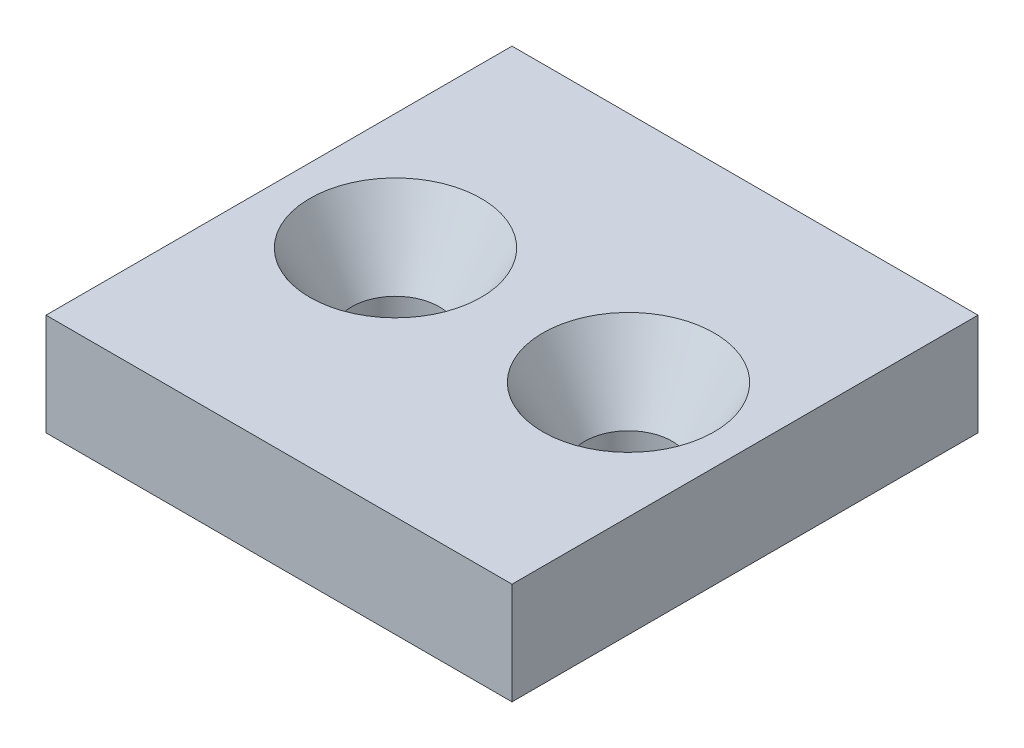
ISO-10303-21;
HEADER;
FILE_DESCRIPTION(('STEP AP214'),'2;1');
FILE_NAME('part.step','',(''),(''),'','','');
FILE_SCHEMA(('AUTOMOTIVE_DESIGN { 1 0 10303 214 1 1 1 1 }'));
ENDSEC;
DATA;
#1=APPLICATION_CONTEXT('core data for automotive mechanical design processes');
#2=APPLICATION_PROTOCOL_DEFINITION('international standard','automotive_design',2000,#1);
#3=PRODUCT_CONTEXT('',#1,'mechanical');
#4=PRODUCT('Part','Part','',(#3));
#5=PRODUCT_RELATED_PRODUCT_CATEGORY('part','',(#4));
#6=PRODUCT_DEFINITION_FORMATION('','',#4);
#7=PRODUCT_DEFINITION_CONTEXT('part definition',#1,'design');
#8=PRODUCT_DEFINITION('design','',#6,#7);
#9=PRODUCT_DEFINITION_SHAPE('','',#8);
#10=(LENGTH_UNIT() NAMED_UNIT(*) SI_UNIT(.MILLI.,.METRE.));
#11=(NAMED_UNIT(*) PLANE_ANGLE_UNIT() SI_UNIT($,.RADIAN.));
#12=(NAMED_UNIT(*) SI_UNIT($,.STERADIAN.) SOLID_ANGLE_UNIT());
#13=UNCERTAINTY_MEASURE_WITH_UNIT(LENGTH_MEASURE(1.E-05),#10,'distance_accuracy_value','');
#14=(GEOMETRIC_REPRESENTATION_CONTEXT(3) GLOBAL_UNCERTAINTY_ASSIGNED_CONTEXT((#13)) GLOBAL_UNIT_ASSIGNED_CONTEXT((#10,
#11,#12)) REPRESENTATION_CONTEXT('',''));
#15=CARTESIAN_POINT('',(0.,0.,0.));
#16=DIRECTION('',(0.,0.,1.));
#17=DIRECTION('',(1.,0.,0.));
#18=AXIS2_PLACEMENT_3D('',#15,#16,#17);
#19=CARTESIAN_POINT('',(16.,7.,16.));
#20=DIRECTION('',(-1.,0.,0.));
#21=DIRECTION('',(0.,0.,1.));
#22=AXIS2_PLACEMENT_3D('',#19,#20,#21);
#23=PLANE('',#22);
#24=DIRECTION('',(0.,0.,-1.));
#25=VECTOR('',#24,1.);
#26=CARTESIAN_POINT('',(16.,0.,16.));
#27=LINE('',#26,#25);
#28=CARTESIAN_POINT('',(16.,0.,16.));
#29=VERTEX_POINT('',#28);
#30=CARTESIAN_POINT('',(16.,0.,-16.));
#31=VERTEX_POINT('',#30);
#32=EDGE_CURVE('E95',#29,#31,#27,.T.);
#33=ORIENTED_EDGE('',*,*,#32,.T.);
#34=DIRECTION('',(0.,-1.,0.));
#35=VECTOR('',#34,1.);
#36=CARTESIAN_POINT('',(16.,7.,-16.));
#37=LINE('',#36,#35);
#38=CARTESIAN_POINT('',(16.,7.,-16.));
#39=VERTEX_POINT('',#38);
#40=EDGE_CURVE('E11',#39,#31,#37,.T.);
#41=ORIENTED_EDGE('',*,*,#40,.F.);
#42=DIRECTION('',(0.,0.,-1.));
#43=VECTOR('',#42,1.);
#44=CARTESIAN_POINT('',(16.,7.,16.));
#45=LINE('',#44,#43);
#46=CARTESIAN_POINT('',(16.,7.,16.));
#47=VERTEX_POINT('',#46);
#48=EDGE_CURVE('E83',#47,#39,#45,.T.);
#49=ORIENTED_EDGE('',*,*,#48,.F.);
#50=DIRECTION('',(0.,-1.,0.));
#51=VECTOR('',#50,1.);
#52=CARTESIAN_POINT('',(16.,7.,16.));
#53=LINE('',#52,#51);
#54=EDGE_CURVE('E91',#47,#29,#53,.T.);
#55=ORIENTED_EDGE('',*,*,#54,.T.);
#56=EDGE_LOOP('',(#33,#41,#49,#55));
#57=FACE_BOUND('',#56,.T.);
#58=ADVANCED_FACE('F32',(#57),#23,.F.);
#59=CARTESIAN_POINT('',(-16.,7.,-16.));
#60=DIRECTION('',(0.,0.,1.));
#61=DIRECTION('',(1.,0.,0.));
#62=AXIS2_PLACEMENT_3D('',#59,#60,#61);
#63=PLANE('',#62);
#64=DIRECTION('',(-1.,0.,0.));
#65=VECTOR('',#64,1.);
#66=CARTESIAN_POINT('',(-16.,0.,-16.));
#67=LINE('',#66,#65);
#68=CARTESIAN_POINT('',(-16.,0.,-16.));
#69=VERTEX_POINT('',#68);
#70=EDGE_CURVE('E87',#31,#69,#67,.T.);
#71=ORIENTED_EDGE('',*,*,#70,.T.);
#72=DIRECTION('',(0.,-1.,0.));
#73=VECTOR('',#72,1.);
#74=CARTESIAN_POINT('',(-16.,7.,-16.));
#75=LINE('',#74,#73);
#76=CARTESIAN_POINT('',(-16.,7.,-16.));
#77=VERTEX_POINT('',#76);
#78=EDGE_CURVE('E40',#77,#69,#75,.T.);
#79=ORIENTED_EDGE('',*,*,#78,.F.);
#80=DIRECTION('',(-1.,0.,0.));
#81=VECTOR('',#80,1.);
#82=CARTESIAN_POINT('',(-16.,7.,-16.));
#83=LINE('',#82,#81);
#84=EDGE_CURVE('E78',#39,#77,#83,.T.);
#85=ORIENTED_EDGE('',*,*,#84,.F.);
#86=ORIENTED_EDGE('',*,*,#40,.T.);
#87=EDGE_LOOP('',(#71,#79,#85,#86));
#88=FACE_BOUND('',#87,.T.);
#89=ADVANCED_FACE('F86',(#88),#63,.F.);
#90=CARTESIAN_POINT('',(-16.,7.,16.));
#91=DIRECTION('',(1.,0.,0.));
#92=DIRECTION('',(0.,0.,-1.));
#93=AXIS2_PLACEMENT_3D('',#90,#91,#92);
#94=PLANE('',#93);
#95=DIRECTION('',(0.,0.,1.));
#96=VECTOR('',#95,1.);
#97=CARTESIAN_POINT('',(-16.,0.,16.));
#98=LINE('',#97,#96);
#99=CARTESIAN_POINT('',(-16.,0.,16.));
#100=VERTEX_POINT('',#99);
#101=EDGE_CURVE('E65',#69,#100,#98,.T.);
#102=ORIENTED_EDGE('',*,*,#101,.T.);
#103=DIRECTION('',(0.,-1.,0.));
#104=VECTOR('',#103,1.);
#105=CARTESIAN_POINT('',(-16.,7.,16.));
#106=LINE('',#105,#104);
#107=CARTESIAN_POINT('',(-16.,7.,16.));
#108=VERTEX_POINT('',#107);
#109=EDGE_CURVE('E88',#108,#100,#106,.T.);
#110=ORIENTED_EDGE('',*,*,#109,.F.);
#111=DIRECTION('',(0.,0.,1.));
#112=VECTOR('',#111,1.);
#113=CARTESIAN_POINT('',(-16.,7.,16.));
#114=LINE('',#113,#112);
#115=EDGE_CURVE('E81',#77,#108,#114,.T.);
#116=ORIENTED_EDGE('',*,*,#115,.F.);
#117=ORIENTED_EDGE('',*,*,#78,.T.);
#118=EDGE_LOOP('',(#102,#110,#116,#117));
#119=FACE_BOUND('',#118,.T.);
#120=ADVANCED_FACE('F89',(#119),#94,.F.);
#121=CARTESIAN_POINT('',(-16.,7.,16.));
#122=DIRECTION('',(0.,0.,-1.));
#123=DIRECTION('',(-1.,0.,0.));
#124=AXIS2_PLACEMENT_3D('',#121,#122,#123);
#125=PLANE('',#124);
#126=DIRECTION('',(1.,0.,0.));
#127=VECTOR('',#126,1.);
#128=CARTESIAN_POINT('',(-16.,0.,16.));
#129=LINE('',#128,#127);
#130=EDGE_CURVE('E71',#100,#29,#129,.T.);
#131=ORIENTED_EDGE('',*,*,#130,.T.);
#132=ORIENTED_EDGE('',*,*,#54,.F.);
#133=DIRECTION('',(1.,0.,0.));
#134=VECTOR('',#133,1.);
#135=CARTESIAN_POINT('',(-16.,7.,16.));
#136=LINE('',#135,#134);
#137=EDGE_CURVE('E48',#108,#47,#136,.T.);
#138=ORIENTED_EDGE('',*,*,#137,.F.);
#139=ORIENTED_EDGE('',*,*,#109,.T.);
#140=EDGE_LOOP('',(#131,#132,#138,#139));
#141=FACE_BOUND('',#140,.T.);
#142=ADVANCED_FACE('F103',(#141),#125,.F.);
#143=CARTESIAN_POINT('',(16.,7.,-16.));
#144=DIRECTION('',(0.,-1.,0.));
#145=DIRECTION('',(0.,0.,-1.));
#146=AXIS2_PLACEMENT_3D('',#143,#144,#145);
#147=PLANE('',#146);
#148=CARTESIAN_POINT('',(-8.,7.,0.));
#149=DIRECTION('',(0.,1.,0.));
#150=DIRECTION('',(0.,0.,1.));
#151=AXIS2_PLACEMENT_3D('',#148,#149,#150);
#152=CIRCLE('',#151,5.885);
#153=CARTESIAN_POINT('',(-8.,7.,5.885));
#154=VERTEX_POINT('',#153);
#155=EDGE_CURVE('E123',#154,#154,#152,.T.);
#156=ORIENTED_EDGE('',*,*,#155,.F.);
#157=EDGE_LOOP('',(#156));
#158=FACE_BOUND('',#157,.T.);
#159=CARTESIAN_POINT('',(8.,7.,0.));
#160=DIRECTION('',(0.,1.,0.));
#161=DIRECTION('',(0.,0.,1.));
#162=AXIS2_PLACEMENT_3D('',#159,#160,#161);
#163=CIRCLE('',#162,5.885);
#164=CARTESIAN_POINT('',(8.,7.,5.885));
#165=VERTEX_POINT('',#164);
#166=EDGE_CURVE('E114',#165,#165,#163,.T.);
#167=ORIENTED_EDGE('',*,*,#166,.F.);
#168=EDGE_LOOP('',(#167));
#169=FACE_BOUND('',#168,.T.);
#170=ORIENTED_EDGE('',*,*,#48,.T.);
#171=ORIENTED_EDGE('',*,*,#84,.T.);
#172=ORIENTED_EDGE('',*,*,#115,.T.);
#173=ORIENTED_EDGE('',*,*,#137,.T.);
#174=EDGE_LOOP('',(#170,#171,#172,#173));
#175=FACE_BOUND('',#174,.T.);
#176=ADVANCED_FACE('F79',(#158,#169,#175),#147,.F.);
#177=CARTESIAN_POINT('',(16.,0.,-16.));
#178=DIRECTION('',(0.,-1.,0.));
#179=DIRECTION('',(0.,0.,-1.));
#180=AXIS2_PLACEMENT_3D('',#177,#178,#179);
#181=PLANE('',#180);
#182=CARTESIAN_POINT('',(-8.,0.,0.));
#183=DIRECTION('',(0.,1.,0.));
#184=DIRECTION('',(0.,0.,1.));
#185=AXIS2_PLACEMENT_3D('',#182,#183,#184);
#186=CIRCLE('',#185,3.);
#187=CARTESIAN_POINT('',(-8.,0.,3.));
#188=VERTEX_POINT('',#187);
#189=EDGE_CURVE('E117',#188,#188,#186,.T.);
#190=ORIENTED_EDGE('',*,*,#189,.T.);
#191=EDGE_LOOP('',(#190));
#192=FACE_BOUND('',#191,.T.);
#193=CARTESIAN_POINT('',(8.,0.,0.));
#194=DIRECTION('',(0.,1.,0.));
#195=DIRECTION('',(0.,0.,1.));
#196=AXIS2_PLACEMENT_3D('',#193,#194,#195);
#197=CIRCLE('',#196,3.);
#198=CARTESIAN_POINT('',(8.,0.,3.));
#199=VERTEX_POINT('',#198);
#200=EDGE_CURVE('E98',#199,#199,#197,.T.);
#201=ORIENTED_EDGE('',*,*,#200,.T.);
#202=EDGE_LOOP('',(#201));
#203=FACE_BOUND('',#202,.T.);
#204=ORIENTED_EDGE('',*,*,#32,.F.);
#205=ORIENTED_EDGE('',*,*,#130,.F.);
#206=ORIENTED_EDGE('',*,*,#101,.F.);
#207=ORIENTED_EDGE('',*,*,#70,.F.);
#208=EDGE_LOOP('',(#204,#205,#206,#207));
#209=FACE_BOUND('',#208,.T.);
#210=ADVANCED_FACE('F106',(#192,#203,#209),#181,.T.);
#211=CARTESIAN_POINT('',(8.,7.,0.));
#212=DIRECTION('',(0.,1.,0.));
#213=DIRECTION('',(0.,0.,1.));
#214=AXIS2_PLACEMENT_3D('',#211,#212,#213);
#215=CYLINDRICAL_SURFACE('',#214,3.);
#216=ORIENTED_EDGE('',*,*,#200,.F.);
#217=EDGE_LOOP('',(#216));
#218=FACE_BOUND('',#217,.T.);
#219=CARTESIAN_POINT('',(8.,2.00303342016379,0.));
#220=DIRECTION('',(0.,1.,0.));
#221=DIRECTION('',(0.,0.,1.));
#222=AXIS2_PLACEMENT_3D('',#219,#220,#221);
#223=CIRCLE('',#222,3.);
#224=CARTESIAN_POINT('',(8.,2.00303342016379,3.));
#225=VERTEX_POINT('',#224);
#226=EDGE_CURVE('E111',#225,#225,#223,.T.);
#227=ORIENTED_EDGE('',*,*,#226,.T.);
#228=EDGE_LOOP('',(#227));
#229=FACE_BOUND('',#228,.T.);
#230=ADVANCED_FACE('F137',(#218,#229),#215,.F.);
#231=CARTESIAN_POINT('',(8.,7.,0.));
#232=DIRECTION('',(0.,1.,0.));
#233=DIRECTION('',(0.,0.,1.));
#234=AXIS2_PLACEMENT_3D('',#231,#232,#233);
#235=CONICAL_SURFACE('',#234,5.885,0.523598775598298);
#236=ORIENTED_EDGE('',*,*,#226,.F.);
#237=EDGE_LOOP('',(#236));
#238=FACE_BOUND('',#237,.T.);
#239=ORIENTED_EDGE('',*,*,#166,.T.);
#240=EDGE_LOOP('',(#239));
#241=FACE_BOUND('',#240,.T.);
#242=ADVANCED_FACE('F134',(#238,#241),#235,.F.);
#243=CARTESIAN_POINT('',(-8.,7.,0.));
#244=DIRECTION('',(0.,1.,0.));
#245=DIRECTION('',(0.,0.,1.));
#246=AXIS2_PLACEMENT_3D('',#243,#244,#245);
#247=CYLINDRICAL_SURFACE('',#246,3.);
#248=ORIENTED_EDGE('',*,*,#189,.F.);
#249=EDGE_LOOP('',(#248));
#250=FACE_BOUND('',#249,.T.);
#251=CARTESIAN_POINT('',(-8.,2.00303342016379,0.));
#252=DIRECTION('',(0.,1.,0.));
#253=DIRECTION('',(0.,0.,1.));
#254=AXIS2_PLACEMENT_3D('',#251,#252,#253);
#255=CIRCLE('',#254,3.);
#256=CARTESIAN_POINT('',(-8.,2.00303342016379,3.));
#257=VERTEX_POINT('',#256);
#258=EDGE_CURVE('E120',#257,#257,#255,.T.);
#259=ORIENTED_EDGE('',*,*,#258,.T.);
#260=EDGE_LOOP('',(#259));
#261=FACE_BOUND('',#260,.T.);
#262=ADVANCED_FACE('F136',(#250,#261),#247,.F.);
#263=CARTESIAN_POINT('',(-8.,7.,0.));
#264=DIRECTION('',(0.,1.,0.));
#265=DIRECTION('',(0.,0.,1.));
#266=AXIS2_PLACEMENT_3D('',#263,#264,#265);
#267=CONICAL_SURFACE('',#266,5.885,0.523598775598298);
#268=ORIENTED_EDGE('',*,*,#258,.F.);
#269=EDGE_LOOP('',(#268));
#270=FACE_BOUND('',#269,.T.);
#271=ORIENTED_EDGE('',*,*,#155,.T.);
#272=EDGE_LOOP('',(#271));
#273=FACE_BOUND('',#272,.T.);
#274=ADVANCED_FACE('F127',(#270,#273),#267,.F.);
#275=CLOSED_SHELL('',(#58,#89,#120,#142,#176,#210,#230,#242,#262,#274));
#276=MANIFOLD_SOLID_BREP('B2',#275);
#277=ADVANCED_BREP_SHAPE_REPRESENTATION('',(#18,#276),#14);
#278=SHAPE_DEFINITION_REPRESENTATION(#9,#277);
ENDSEC;
END-ISO-10303-21;
